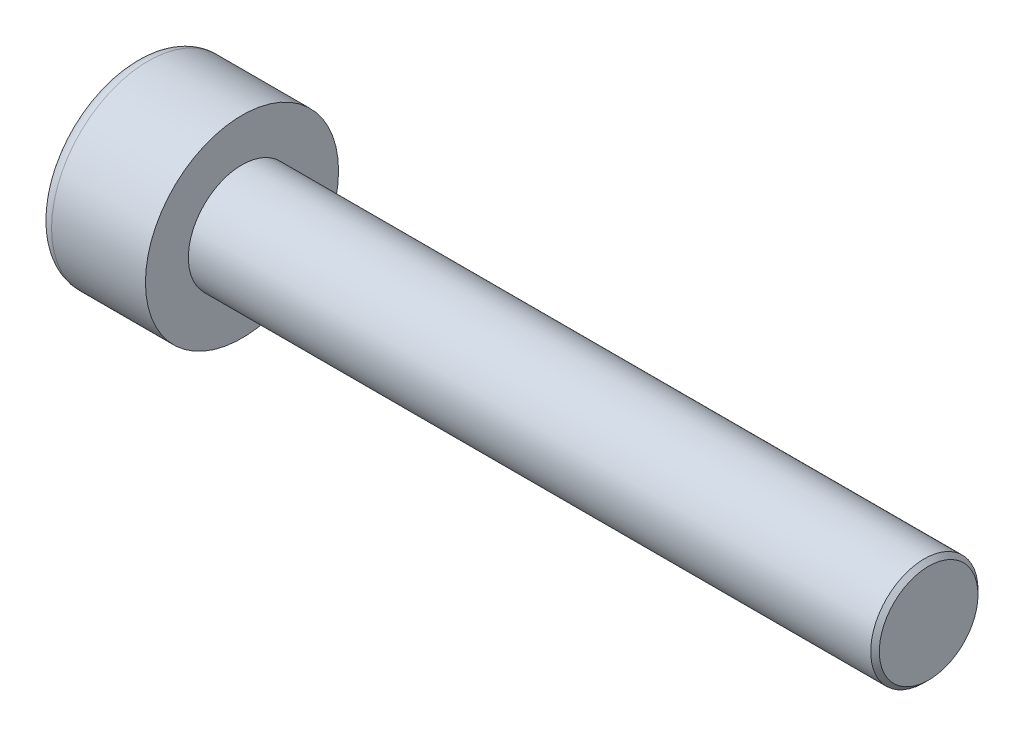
ISO-10303-21;
HEADER;
FILE_DESCRIPTION(('STEP AP214'),'2;1');
FILE_NAME('part.step','',(''),(''),'','','');
FILE_SCHEMA(('AUTOMOTIVE_DESIGN { 1 0 10303 214 1 1 1 1 }'));
ENDSEC;
DATA;
#1=APPLICATION_CONTEXT('core data for automotive mechanical design processes');
#2=APPLICATION_PROTOCOL_DEFINITION('international standard','automotive_design',2000,#1);
#3=PRODUCT_CONTEXT('',#1,'mechanical');
#4=PRODUCT('Part','Part','',(#3));
#5=PRODUCT_RELATED_PRODUCT_CATEGORY('part','',(#4));
#6=PRODUCT_DEFINITION_FORMATION('','',#4);
#7=PRODUCT_DEFINITION_CONTEXT('part definition',#1,'design');
#8=PRODUCT_DEFINITION('design','',#6,#7);
#9=PRODUCT_DEFINITION_SHAPE('','',#8);
#10=(LENGTH_UNIT() NAMED_UNIT(*) SI_UNIT(.MILLI.,.METRE.));
#11=(NAMED_UNIT(*) PLANE_ANGLE_UNIT() SI_UNIT($,.RADIAN.));
#12=(NAMED_UNIT(*) SI_UNIT($,.STERADIAN.) SOLID_ANGLE_UNIT());
#13=UNCERTAINTY_MEASURE_WITH_UNIT(LENGTH_MEASURE(1.E-05),#10,'distance_accuracy_value','');
#14=(GEOMETRIC_REPRESENTATION_CONTEXT(3) GLOBAL_UNCERTAINTY_ASSIGNED_CONTEXT((#13)) GLOBAL_UNIT_ASSIGNED_CONTEXT((#10,
#11,#12)) REPRESENTATION_CONTEXT('',''));
#15=CARTESIAN_POINT('',(0.,0.,0.));
#16=DIRECTION('',(0.,0.,1.));
#17=DIRECTION('',(1.,0.,0.));
#18=AXIS2_PLACEMENT_3D('',#15,#16,#17);
#19=CARTESIAN_POINT('',(1.1,0.,-1.15470053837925));
#20=DIRECTION('',(1.,0.,0.));
#21=DIRECTION('',(0.,0.,-1.));
#22=AXIS2_PLACEMENT_3D('',#19,#20,#21);
#23=PLANE('',#22);
#24=CARTESIAN_POINT('',(1.1,0.,0.));
#25=DIRECTION('',(1.,0.,0.));
#26=DIRECTION('',(0.,0.,-1.));
#27=AXIS2_PLACEMENT_3D('',#24,#25,#26);
#28=CIRCLE('',#27,1.);
#29=CARTESIAN_POINT('',(1.1,-0.5,-0.866025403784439));
#30=VERTEX_POINT('',#29);
#31=CARTESIAN_POINT('',(1.1,-1.,0.));
#32=VERTEX_POINT('',#31);
#33=EDGE_CURVE('E164',#30,#32,#28,.F.);
#34=ORIENTED_EDGE('',*,*,#33,.F.);
#35=DIRECTION('',(0.,0.866025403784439,-0.5));
#36=VECTOR('',#35,1.);
#37=CARTESIAN_POINT('',(1.1,-1.,-0.577350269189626));
#38=LINE('',#37,#36);
#39=CARTESIAN_POINT('',(1.1,-1.,-0.577350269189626));
#40=VERTEX_POINT('',#39);
#41=EDGE_CURVE('E172',#40,#30,#38,.T.);
#42=ORIENTED_EDGE('',*,*,#41,.F.);
#43=DIRECTION('',(0.,0.,-1.));
#44=VECTOR('',#43,1.);
#45=CARTESIAN_POINT('',(1.1,-1.,0.577350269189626));
#46=LINE('',#45,#44);
#47=EDGE_CURVE('E189',#32,#40,#46,.T.);
#48=ORIENTED_EDGE('',*,*,#47,.F.);
#49=EDGE_LOOP('',(#34,#42,#48));
#50=FACE_BOUND('',#49,.T.);
#51=ADVANCED_FACE('F41',(#50),#23,.F.);
#52=CARTESIAN_POINT('',(1.1,-0.5,0.866025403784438));
#53=VERTEX_POINT('',#52);
#54=EDGE_CURVE('E294',#32,#53,#28,.F.);
#55=ORIENTED_EDGE('',*,*,#54,.F.);
#56=CARTESIAN_POINT('',(1.1,-1.,0.577350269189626));
#57=VERTEX_POINT('',#56);
#58=EDGE_CURVE('E190',#57,#32,#46,.T.);
#59=ORIENTED_EDGE('',*,*,#58,.F.);
#60=DIRECTION('',(0.,-0.866025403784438,-0.5));
#61=VECTOR('',#60,1.);
#62=CARTESIAN_POINT('',(1.1,0.,1.15470053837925));
#63=LINE('',#62,#61);
#64=EDGE_CURVE('E185',#53,#57,#63,.T.);
#65=ORIENTED_EDGE('',*,*,#64,.F.);
#66=EDGE_LOOP('',(#55,#59,#65));
#67=FACE_BOUND('',#66,.T.);
#68=ADVANCED_FACE('F130',(#67),#23,.F.);
#69=CARTESIAN_POINT('',(1.1,0.5,0.866025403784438));
#70=VERTEX_POINT('',#69);
#71=EDGE_CURVE('E290',#53,#70,#28,.F.);
#72=ORIENTED_EDGE('',*,*,#71,.F.);
#73=CARTESIAN_POINT('',(1.1,0.,1.15470053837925));
#74=VERTEX_POINT('',#73);
#75=EDGE_CURVE('E186',#74,#53,#63,.T.);
#76=ORIENTED_EDGE('',*,*,#75,.F.);
#77=DIRECTION('',(0.,-0.866025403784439,0.5));
#78=VECTOR('',#77,1.);
#79=CARTESIAN_POINT('',(1.1,1.,0.577350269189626));
#80=LINE('',#79,#78);
#81=EDGE_CURVE('E181',#70,#74,#80,.T.);
#82=ORIENTED_EDGE('',*,*,#81,.F.);
#83=EDGE_LOOP('',(#72,#76,#82));
#84=FACE_BOUND('',#83,.T.);
#85=ADVANCED_FACE('F136',(#84),#23,.F.);
#86=CARTESIAN_POINT('',(1.1,1.,0.));
#87=VERTEX_POINT('',#86);
#88=EDGE_CURVE('E161',#70,#87,#28,.F.);
#89=ORIENTED_EDGE('',*,*,#88,.F.);
#90=CARTESIAN_POINT('',(1.1,1.,0.577350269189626));
#91=VERTEX_POINT('',#90);
#92=EDGE_CURVE('E182',#91,#70,#80,.T.);
#93=ORIENTED_EDGE('',*,*,#92,.F.);
#94=DIRECTION('',(0.,0.,1.));
#95=VECTOR('',#94,1.);
#96=CARTESIAN_POINT('',(1.1,1.,-0.577350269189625));
#97=LINE('',#96,#95);
#98=EDGE_CURVE('E176',#87,#91,#97,.T.);
#99=ORIENTED_EDGE('',*,*,#98,.F.);
#100=EDGE_LOOP('',(#89,#93,#99));
#101=FACE_BOUND('',#100,.T.);
#102=ADVANCED_FACE('F150',(#101),#23,.F.);
#103=CARTESIAN_POINT('',(1.1,0.,0.));
#104=DIRECTION('',(1.,0.,0.));
#105=DIRECTION('',(0.,0.,-1.));
#106=AXIS2_PLACEMENT_3D('',#103,#104,#105);
#107=CIRCLE('',#106,1.);
#108=CARTESIAN_POINT('',(1.1,0.5,-0.866025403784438));
#109=VERTEX_POINT('',#108);
#110=EDGE_CURVE('E56',#109,#87,#107,.T.);
#111=ORIENTED_EDGE('',*,*,#110,.T.);
#112=CARTESIAN_POINT('',(1.1,1.,-0.577350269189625));
#113=VERTEX_POINT('',#112);
#114=EDGE_CURVE('E169',#113,#87,#97,.T.);
#115=ORIENTED_EDGE('',*,*,#114,.F.);
#116=DIRECTION('',(0.,0.866025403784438,0.5));
#117=VECTOR('',#116,1.);
#118=CARTESIAN_POINT('',(1.1,0.,-1.15470053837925));
#119=LINE('',#118,#117);
#120=EDGE_CURVE('E166',#109,#113,#119,.T.);
#121=ORIENTED_EDGE('',*,*,#120,.F.);
#122=EDGE_LOOP('',(#111,#115,#121));
#123=FACE_BOUND('',#122,.T.);
#124=ADVANCED_FACE('F141',(#123),#23,.F.);
#125=EDGE_CURVE('E154',#109,#30,#28,.F.);
#126=ORIENTED_EDGE('',*,*,#125,.F.);
#127=CARTESIAN_POINT('',(1.1,0.,-1.15470053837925));
#128=VERTEX_POINT('',#127);
#129=EDGE_CURVE('E157',#128,#109,#119,.T.);
#130=ORIENTED_EDGE('',*,*,#129,.F.);
#131=EDGE_CURVE('E159',#30,#128,#38,.T.);
#132=ORIENTED_EDGE('',*,*,#131,.F.);
#133=EDGE_LOOP('',(#126,#130,#132));
#134=FACE_BOUND('',#133,.T.);
#135=ADVANCED_FACE('F132',(#134),#23,.F.);
#136=CARTESIAN_POINT('',(0.,0.,0.));
#137=DIRECTION('',(1.,0.,0.));
#138=DIRECTION('',(0.,0.,-1.));
#139=AXIS2_PLACEMENT_3D('',#136,#137,#138);
#140=PLANE('',#139);
#141=CARTESIAN_POINT('',(0.,0.,0.));
#142=DIRECTION('',(1.,0.,0.));
#143=DIRECTION('',(0.,0.,-1.));
#144=AXIS2_PLACEMENT_3D('',#141,#142,#143);
#145=CIRCLE('',#144,1.9375);
#146=CARTESIAN_POINT('',(0.,0.,-1.9375));
#147=VERTEX_POINT('',#146);
#148=EDGE_CURVE('E229',#147,#147,#145,.F.);
#149=ORIENTED_EDGE('',*,*,#148,.T.);
#150=EDGE_LOOP('',(#149));
#151=FACE_BOUND('',#150,.T.);
#152=DIRECTION('',(0.,0.866025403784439,-0.5));
#153=VECTOR('',#152,1.);
#154=CARTESIAN_POINT('',(0.,-1.,-0.577350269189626));
#155=LINE('',#154,#153);
#156=CARTESIAN_POINT('',(0.,-1.,-0.577350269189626));
#157=VERTEX_POINT('',#156);
#158=CARTESIAN_POINT('',(0.,0.,-1.15470053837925));
#159=VERTEX_POINT('',#158);
#160=EDGE_CURVE('E64',#157,#159,#155,.T.);
#161=ORIENTED_EDGE('',*,*,#160,.T.);
#162=DIRECTION('',(0.,0.866025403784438,0.5));
#163=VECTOR('',#162,1.);
#164=CARTESIAN_POINT('',(0.,0.,-1.15470053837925));
#165=LINE('',#164,#163);
#166=CARTESIAN_POINT('',(0.,1.,-0.577350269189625));
#167=VERTEX_POINT('',#166);
#168=EDGE_CURVE('E195',#159,#167,#165,.T.);
#169=ORIENTED_EDGE('',*,*,#168,.T.);
#170=DIRECTION('',(0.,0.,1.));
#171=VECTOR('',#170,1.);
#172=CARTESIAN_POINT('',(0.,1.,-0.577350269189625));
#173=LINE('',#172,#171);
#174=CARTESIAN_POINT('',(0.,1.,0.577350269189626));
#175=VERTEX_POINT('',#174);
#176=EDGE_CURVE('E198',#167,#175,#173,.T.);
#177=ORIENTED_EDGE('',*,*,#176,.T.);
#178=DIRECTION('',(0.,-0.866025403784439,0.5));
#179=VECTOR('',#178,1.);
#180=CARTESIAN_POINT('',(0.,1.,0.577350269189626));
#181=LINE('',#180,#179);
#182=CARTESIAN_POINT('',(0.,0.,1.15470053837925));
#183=VERTEX_POINT('',#182);
#184=EDGE_CURVE('E201',#175,#183,#181,.T.);
#185=ORIENTED_EDGE('',*,*,#184,.T.);
#186=DIRECTION('',(0.,-0.866025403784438,-0.5));
#187=VECTOR('',#186,1.);
#188=CARTESIAN_POINT('',(0.,0.,1.15470053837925));
#189=LINE('',#188,#187);
#190=CARTESIAN_POINT('',(0.,-1.,0.577350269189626));
#191=VERTEX_POINT('',#190);
#192=EDGE_CURVE('E204',#183,#191,#189,.T.);
#193=ORIENTED_EDGE('',*,*,#192,.T.);
#194=DIRECTION('',(0.,0.,-1.));
#195=VECTOR('',#194,1.);
#196=CARTESIAN_POINT('',(0.,-1.,0.577350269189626));
#197=LINE('',#196,#195);
#198=EDGE_CURVE('E207',#191,#157,#197,.T.);
#199=ORIENTED_EDGE('',*,*,#198,.T.);
#200=EDGE_LOOP('',(#161,#169,#177,#185,#193,#199));
#201=FACE_BOUND('',#200,.T.);
#202=ADVANCED_FACE('F140',(#151,#201),#140,.F.);
#203=CARTESIAN_POINT('',(2.5,0.,0.));
#204=DIRECTION('',(1.,0.,0.));
#205=DIRECTION('',(0.,0.,-1.));
#206=AXIS2_PLACEMENT_3D('',#203,#204,#205);
#207=PLANE('',#206);
#208=CARTESIAN_POINT('',(2.5,0.,0.));
#209=DIRECTION('',(1.,0.,0.));
#210=DIRECTION('',(0.,0.,-1.));
#211=AXIS2_PLACEMENT_3D('',#208,#209,#210);
#212=CIRCLE('',#211,2.25);
#213=CARTESIAN_POINT('',(2.5,0.,-2.25));
#214=VERTEX_POINT('',#213);
#215=EDGE_CURVE('E162',#214,#214,#212,.T.);
#216=ORIENTED_EDGE('',*,*,#215,.T.);
#217=EDGE_LOOP('',(#216));
#218=FACE_BOUND('',#217,.T.);
#219=CARTESIAN_POINT('',(2.5,0.,0.));
#220=DIRECTION('',(1.,0.,0.));
#221=DIRECTION('',(0.,0.,-1.));
#222=AXIS2_PLACEMENT_3D('',#219,#220,#221);
#223=CIRCLE('',#222,1.25);
#224=CARTESIAN_POINT('',(2.5,0.,-1.25));
#225=VERTEX_POINT('',#224);
#226=EDGE_CURVE('E220',#225,#225,#223,.T.);
#227=ORIENTED_EDGE('',*,*,#226,.F.);
#228=EDGE_LOOP('',(#227));
#229=FACE_BOUND('',#228,.T.);
#230=ADVANCED_FACE('F147',(#218,#229),#207,.T.);
#231=CARTESIAN_POINT('',(2.5,0.,0.));
#232=DIRECTION('',(-1.,0.,0.));
#233=DIRECTION('',(0.,0.,1.));
#234=AXIS2_PLACEMENT_3D('',#231,#232,#233);
#235=CYLINDRICAL_SURFACE('',#234,2.25);
#236=CARTESIAN_POINT('',(0.3125,0.,0.));
#237=DIRECTION('',(1.,0.,0.));
#238=DIRECTION('',(0.,0.,-1.));
#239=AXIS2_PLACEMENT_3D('',#236,#237,#238);
#240=CIRCLE('',#239,2.25);
#241=CARTESIAN_POINT('',(0.3125,0.,-2.25));
#242=VERTEX_POINT('',#241);
#243=EDGE_CURVE('E226',#242,#242,#240,.T.);
#244=ORIENTED_EDGE('',*,*,#243,.T.);
#245=EDGE_LOOP('',(#244));
#246=FACE_BOUND('',#245,.T.);
#247=ORIENTED_EDGE('',*,*,#215,.F.);
#248=EDGE_LOOP('',(#247));
#249=FACE_BOUND('',#248,.T.);
#250=ADVANCED_FACE('F245',(#246,#249),#235,.T.);
#251=CARTESIAN_POINT('',(18.5,0.,0.));
#252=DIRECTION('',(-1.,0.,0.));
#253=DIRECTION('',(0.,0.,1.));
#254=AXIS2_PLACEMENT_3D('',#251,#252,#253);
#255=CYLINDRICAL_SURFACE('',#254,1.25);
#256=CARTESIAN_POINT('',(18.4,0.,0.));
#257=DIRECTION('',(1.,0.,0.));
#258=DIRECTION('',(0.,0.,-1.));
#259=AXIS2_PLACEMENT_3D('',#256,#257,#258);
#260=CIRCLE('',#259,1.25);
#261=CARTESIAN_POINT('',(18.4,0.,-1.25));
#262=VERTEX_POINT('',#261);
#263=EDGE_CURVE('E11',#262,#262,#260,.F.);
#264=ORIENTED_EDGE('',*,*,#263,.T.);
#265=EDGE_LOOP('',(#264));
#266=FACE_BOUND('',#265,.T.);
#267=ORIENTED_EDGE('',*,*,#226,.T.);
#268=EDGE_LOOP('',(#267));
#269=FACE_BOUND('',#268,.T.);
#270=ADVANCED_FACE('F242',(#266,#269),#255,.T.);
#271=CARTESIAN_POINT('',(18.5,0.,0.));
#272=DIRECTION('',(1.,0.,0.));
#273=DIRECTION('',(0.,0.,-1.));
#274=AXIS2_PLACEMENT_3D('',#271,#272,#273);
#275=PLANE('',#274);
#276=CARTESIAN_POINT('',(18.5,0.,0.));
#277=DIRECTION('',(1.,0.,0.));
#278=DIRECTION('',(0.,0.,-1.));
#279=AXIS2_PLACEMENT_3D('',#276,#277,#278);
#280=CIRCLE('',#279,1.15);
#281=CARTESIAN_POINT('',(18.5,0.,-1.15));
#282=VERTEX_POINT('',#281);
#283=EDGE_CURVE('E49',#282,#282,#280,.T.);
#284=ORIENTED_EDGE('',*,*,#283,.T.);
#285=EDGE_LOOP('',(#284));
#286=FACE_BOUND('',#285,.T.);
#287=ADVANCED_FACE('F234',(#286),#275,.T.);
#288=CARTESIAN_POINT('',(1.1,-1.,-0.577350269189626));
#289=DIRECTION('',(0.,0.5,0.866025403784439));
#290=DIRECTION('',(0.,-0.866025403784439,0.5));
#291=AXIS2_PLACEMENT_3D('',#288,#289,#290);
#292=PLANE('',#291);
#293=ORIENTED_EDGE('',*,*,#160,.F.);
#294=DIRECTION('',(-1.,0.,0.));
#295=VECTOR('',#294,1.);
#296=CARTESIAN_POINT('',(1.1,-1.,-0.577350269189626));
#297=LINE('',#296,#295);
#298=EDGE_CURVE('E193',#40,#157,#297,.T.);
#299=ORIENTED_EDGE('',*,*,#298,.F.);
#300=ORIENTED_EDGE('',*,*,#41,.T.);
#301=ORIENTED_EDGE('',*,*,#131,.T.);
#302=DIRECTION('',(-1.,0.,0.));
#303=VECTOR('',#302,1.);
#304=CARTESIAN_POINT('',(1.1,0.,-1.15470053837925));
#305=LINE('',#304,#303);
#306=EDGE_CURVE('E175',#128,#159,#305,.T.);
#307=ORIENTED_EDGE('',*,*,#306,.T.);
#308=EDGE_LOOP('',(#293,#299,#300,#301,#307));
#309=FACE_BOUND('',#308,.T.);
#310=ADVANCED_FACE('F260',(#309),#292,.T.);
#311=CARTESIAN_POINT('',(1.1,0.,-1.15470053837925));
#312=DIRECTION('',(0.,-0.5,0.866025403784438));
#313=DIRECTION('',(0.,-0.866025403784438,-0.5));
#314=AXIS2_PLACEMENT_3D('',#311,#312,#313);
#315=PLANE('',#314);
#316=ORIENTED_EDGE('',*,*,#168,.F.);
#317=ORIENTED_EDGE('',*,*,#306,.F.);
#318=ORIENTED_EDGE('',*,*,#129,.T.);
#319=ORIENTED_EDGE('',*,*,#120,.T.);
#320=DIRECTION('',(-1.,0.,0.));
#321=VECTOR('',#320,1.);
#322=CARTESIAN_POINT('',(1.1,1.,-0.577350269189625));
#323=LINE('',#322,#321);
#324=EDGE_CURVE('E217',#113,#167,#323,.T.);
#325=ORIENTED_EDGE('',*,*,#324,.T.);
#326=EDGE_LOOP('',(#316,#317,#318,#319,#325));
#327=FACE_BOUND('',#326,.T.);
#328=ADVANCED_FACE('F174',(#327),#315,.T.);
#329=CARTESIAN_POINT('',(1.1,1.,-0.577350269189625));
#330=DIRECTION('',(0.,-1.,0.));
#331=DIRECTION('',(0.,0.,-1.));
#332=AXIS2_PLACEMENT_3D('',#329,#330,#331);
#333=PLANE('',#332);
#334=ORIENTED_EDGE('',*,*,#176,.F.);
#335=ORIENTED_EDGE('',*,*,#324,.F.);
#336=ORIENTED_EDGE('',*,*,#114,.T.);
#337=ORIENTED_EDGE('',*,*,#98,.T.);
#338=DIRECTION('',(-1.,0.,0.));
#339=VECTOR('',#338,1.);
#340=CARTESIAN_POINT('',(1.1,1.,0.577350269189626));
#341=LINE('',#340,#339);
#342=EDGE_CURVE('E215',#91,#175,#341,.T.);
#343=ORIENTED_EDGE('',*,*,#342,.T.);
#344=EDGE_LOOP('',(#334,#335,#336,#337,#343));
#345=FACE_BOUND('',#344,.T.);
#346=ADVANCED_FACE('F265',(#345),#333,.T.);
#347=CARTESIAN_POINT('',(1.1,1.,0.577350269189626));
#348=DIRECTION('',(0.,-0.5,-0.866025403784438));
#349=DIRECTION('',(0.,0.866025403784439,-0.5));
#350=AXIS2_PLACEMENT_3D('',#347,#348,#349);
#351=PLANE('',#350);
#352=ORIENTED_EDGE('',*,*,#184,.F.);
#353=ORIENTED_EDGE('',*,*,#342,.F.);
#354=ORIENTED_EDGE('',*,*,#92,.T.);
#355=ORIENTED_EDGE('',*,*,#81,.T.);
#356=DIRECTION('',(-1.,0.,0.));
#357=VECTOR('',#356,1.);
#358=CARTESIAN_POINT('',(1.1,0.,1.15470053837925));
#359=LINE('',#358,#357);
#360=EDGE_CURVE('E213',#74,#183,#359,.T.);
#361=ORIENTED_EDGE('',*,*,#360,.T.);
#362=EDGE_LOOP('',(#352,#353,#354,#355,#361));
#363=FACE_BOUND('',#362,.T.);
#364=ADVANCED_FACE('F268',(#363),#351,.T.);
#365=CARTESIAN_POINT('',(1.1,0.,1.15470053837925));
#366=DIRECTION('',(0.,0.5,-0.866025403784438));
#367=DIRECTION('',(0.,0.866025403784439,0.5));
#368=AXIS2_PLACEMENT_3D('',#365,#366,#367);
#369=PLANE('',#368);
#370=ORIENTED_EDGE('',*,*,#192,.F.);
#371=ORIENTED_EDGE('',*,*,#360,.F.);
#372=ORIENTED_EDGE('',*,*,#75,.T.);
#373=ORIENTED_EDGE('',*,*,#64,.T.);
#374=DIRECTION('',(-1.,0.,0.));
#375=VECTOR('',#374,1.);
#376=CARTESIAN_POINT('',(1.1,-1.,0.577350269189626));
#377=LINE('',#376,#375);
#378=EDGE_CURVE('E211',#57,#191,#377,.T.);
#379=ORIENTED_EDGE('',*,*,#378,.T.);
#380=EDGE_LOOP('',(#370,#371,#372,#373,#379));
#381=FACE_BOUND('',#380,.T.);
#382=ADVANCED_FACE('F125',(#381),#369,.T.);
#383=CARTESIAN_POINT('',(1.1,-1.,0.577350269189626));
#384=DIRECTION('',(0.,1.,0.));
#385=DIRECTION('',(0.,0.,1.));
#386=AXIS2_PLACEMENT_3D('',#383,#384,#385);
#387=PLANE('',#386);
#388=ORIENTED_EDGE('',*,*,#198,.F.);
#389=ORIENTED_EDGE('',*,*,#378,.F.);
#390=ORIENTED_EDGE('',*,*,#58,.T.);
#391=ORIENTED_EDGE('',*,*,#47,.T.);
#392=ORIENTED_EDGE('',*,*,#298,.T.);
#393=EDGE_LOOP('',(#388,#389,#390,#391,#392));
#394=FACE_BOUND('',#393,.T.);
#395=ADVANCED_FACE('F118',(#394),#387,.T.);
#396=CARTESIAN_POINT('',(1.1,0.,0.));
#397=DIRECTION('',(-1.,0.,0.));
#398=DIRECTION('',(0.,0.,1.));
#399=AXIS2_PLACEMENT_3D('',#396,#397,#398);
#400=CONICAL_SURFACE('',#399,1.,1.04719755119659);
#401=CARTESIAN_POINT('',(1.67735026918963,0.,0.));
#402=VERTEX_POINT('',#401);
#403=VERTEX_LOOP('',#402);
#404=FACE_BOUND('',#403,.T.);
#405=ORIENTED_EDGE('',*,*,#110,.F.);
#406=ORIENTED_EDGE('',*,*,#125,.T.);
#407=ORIENTED_EDGE('',*,*,#33,.T.);
#408=ORIENTED_EDGE('',*,*,#54,.T.);
#409=ORIENTED_EDGE('',*,*,#71,.T.);
#410=ORIENTED_EDGE('',*,*,#88,.T.);
#411=EDGE_LOOP('',(#405,#406,#407,#408,#409,#410));
#412=FACE_BOUND('',#411,.T.);
#413=ADVANCED_FACE('F115',(#404,#412),#400,.F.);
#414=CARTESIAN_POINT('',(0.3125,0.,0.));
#415=DIRECTION('',(1.,0.,0.));
#416=DIRECTION('',(0.,0.,-1.));
#417=AXIS2_PLACEMENT_3D('',#414,#415,#416);
#418=TOROIDAL_SURFACE('',#417,1.9375,0.3125);
#419=ORIENTED_EDGE('',*,*,#148,.F.);
#420=EDGE_LOOP('',(#419));
#421=FACE_BOUND('',#420,.T.);
#422=ORIENTED_EDGE('',*,*,#243,.F.);
#423=EDGE_LOOP('',(#422));
#424=FACE_BOUND('',#423,.T.);
#425=ADVANCED_FACE('F117',(#421,#424),#418,.T.);
#426=CARTESIAN_POINT('',(18.5,0.,0.));
#427=DIRECTION('',(-1.,0.,0.));
#428=DIRECTION('',(0.,0.,1.));
#429=AXIS2_PLACEMENT_3D('',#426,#427,#428);
#430=CONICAL_SURFACE('',#429,1.15,0.78539816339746);
#431=ORIENTED_EDGE('',*,*,#263,.F.);
#432=EDGE_LOOP('',(#431));
#433=FACE_BOUND('',#432,.T.);
#434=ORIENTED_EDGE('',*,*,#283,.F.);
#435=EDGE_LOOP('',(#434));
#436=FACE_BOUND('',#435,.T.);
#437=ADVANCED_FACE('F43',(#433,#436),#430,.T.);
#438=CLOSED_SHELL('',(#51,#68,#85,#102,#124,#135,#202,#230,#250,#270,#287,#310,#328,#346,#364,
#382,#395,#413,#425,#437));
#439=MANIFOLD_SOLID_BREP('B2',#438);
#440=ADVANCED_BREP_SHAPE_REPRESENTATION('',(#18,#439),#14);
#441=SHAPE_DEFINITION_REPRESENTATION(#9,#440);
ENDSEC;
END-ISO-10303-21;
